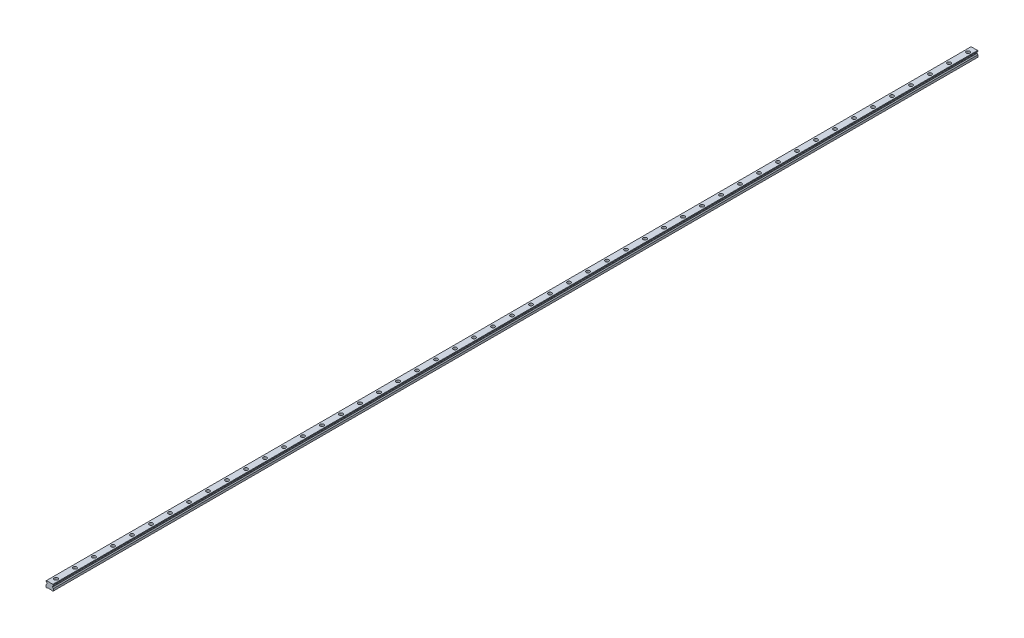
from build123d import *

# Parameters (mm, degrees)
SKETCH1_W           = 23
SKETCH1_H           = 19.2
BOSS_EXTRUDE1_DEPTH = 1460
CUT_EXTRUDE1_DEPTH  = 2921.085767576
CHAMFER1_SIZE       = 1.25
FILLET1_R           = 1.25
CUT_EXTRUDE2_DEPTH  = 2921.085767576
SKETCH4_R           = 5.5
SKETCH4_R_2         = 3.5
CUT_EXTRUDE3_DEPTH  = 9
SKETCH4_2_R         = 3.5
CUT_EXTRUDE4_DEPTH  = 1461.171527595
LPATTERN1_COUNT     = 49
LPATTERN1_PITCH     = 60


with BuildPart() as part:
    # Sketch1 → Boss-Extrude1 (new, symmetric)
    with BuildSketch(Plane.XY):
        with Locations((0, 9.6)):
            Rectangle(SKETCH1_W, SKETCH1_H)
    extrude(amount=BOSS_EXTRUDE1_DEPTH, both=True)

    # Sketch2 → Cut-Extrude1 (cut, through all)
    with BuildSketch(Plane.XY.offset(1460)):
        Polygon((-11.5, 16.7), (-11.5, 7.95), (-8.583333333, 10.866666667), (-8.583333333, 13.783333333), align=None)
        Polygon((8.583333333, 13.783333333), (11.5, 16.7), (11.5, 7.95), (8.583333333, 10.866666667), align=None)
    extrude(amount=-CUT_EXTRUDE1_DEPTH, mode=Mode.SUBTRACT)

    # Chamfer1
    chamfer1_edges = [part.edges().sort_by_distance(p)[0] for p in [
        (-11.5, 19.2, 0),
        (11.5, 19.2, 0),
        (11.5, 0, 0),
        (-11.5, 0, 0),
    ]]
    chamfer(chamfer1_edges, length=CHAMFER1_SIZE)

    # Fillet1
    fillet1_edges = [part.edges().sort_by_distance(p)[0] for p in [
        (-8.583333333, 13.783333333, 0),
        (-8.583333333, 10.866666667, 0),
        (8.583333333, 10.866666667, 0),
        (8.583333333, 13.783333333, 0),
    ]]
    fillet(fillet1_edges, radius=FILLET1_R)

    # Sketch3 → Cut-Extrude2 (cut, through all)
    with BuildSketch(Plane.XY.offset(1460)):
        Polygon((-7, 0), (-5.75, 1.25), (5.75, 1.25), (7, 0), align=None)
    extrude(amount=-CUT_EXTRUDE2_DEPTH, mode=Mode.SUBTRACT)

    # Sketch4 → Cut-Extrude3 (cut)
    with BuildSketch(Plane(origin=(0, 19.2, 0), x_dir=(1, 0, 0), z_dir=(0, 1, 0))):
        with Locations(Location((0, -1440, 0), (0, 0, 270))):
            Circle(SKETCH4_R)
        with Locations(Location((0, -1440, 0), (0, 0, 270))):
            Circle(SKETCH4_R_2, mode=Mode.SUBTRACT)
    cut_extrude3 = extrude(amount=-CUT_EXTRUDE3_DEPTH, mode=Mode.SUBTRACT)

    # Sketch4_2 → Cut-Extrude4 (cut, through all)
    with BuildSketch(Plane(origin=(0, 19.2, 0), x_dir=(1, 0, 0), z_dir=(0, 1, 0))):
        with Locations(Location((0, -1440, 0), (0, 0, 270))):
            Circle(SKETCH4_2_R)
    cut_extrude4 = extrude(amount=-CUT_EXTRUDE4_DEPTH, mode=Mode.SUBTRACT)

    # LPattern1: Cut-Extrude3, Cut-Extrude4 ×49
    with Locations(*[(0, 0, -i * LPATTERN1_PITCH) for i in range(1, LPATTERN1_COUNT)]):
        add(cut_extrude3, mode=Mode.SUBTRACT)
        add(cut_extrude4, mode=Mode.SUBTRACT)


solid = part.part
